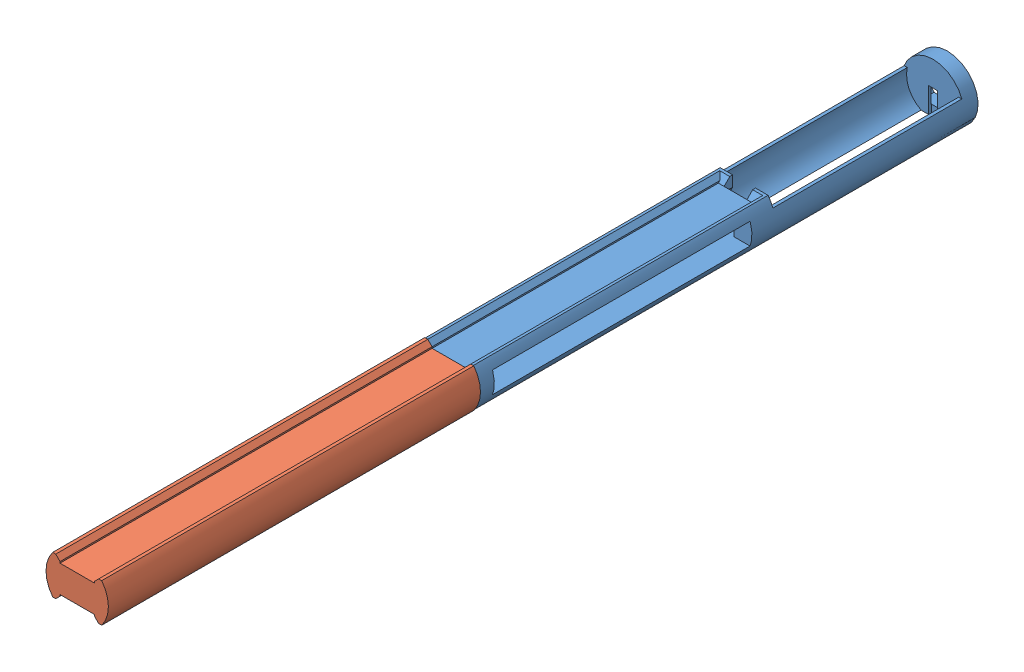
SolidWorks assembly 組合件1.sldasm, configuration 預設 (file format 11000). Lengths in mm.
Overall size (21.8 17.5 304).
2 component instances, 2 part files, 3 mates.
Components (placement in the parent):
- core-1: core.SLDPRT [預設] at (-1.0684 -1.1987 174) size (21.5 17.5 174)
- core_front-1: core_front.SLDPRT [預設] at (-1.0684 -1.1987 274) size (21.8 13.5 130)
Mates (geometry in assembly coordinates):
- 重合/共線/共點1: coincident: plane of core-1 through (-1.0684 -1.1987 274) normal (0 0 1); plane of core_front-1 through (-1.0684 -1.1987 274) normal (0 0 -1)
- 重合/共線/共點2: coincident: line of core-1 through (-7.0684 3.5513 274) axis (0 0 -1); line of core_front-1 through (-7.0684 3.5513 404) axis (0 0 -1)
- 重合/共線/共點3: coincident: line of core-1 through (4.9316 3.5513 274) axis (0 0 -1); line of core_front-1 through (4.9316 3.5513 404) axis (0 0 -1)
